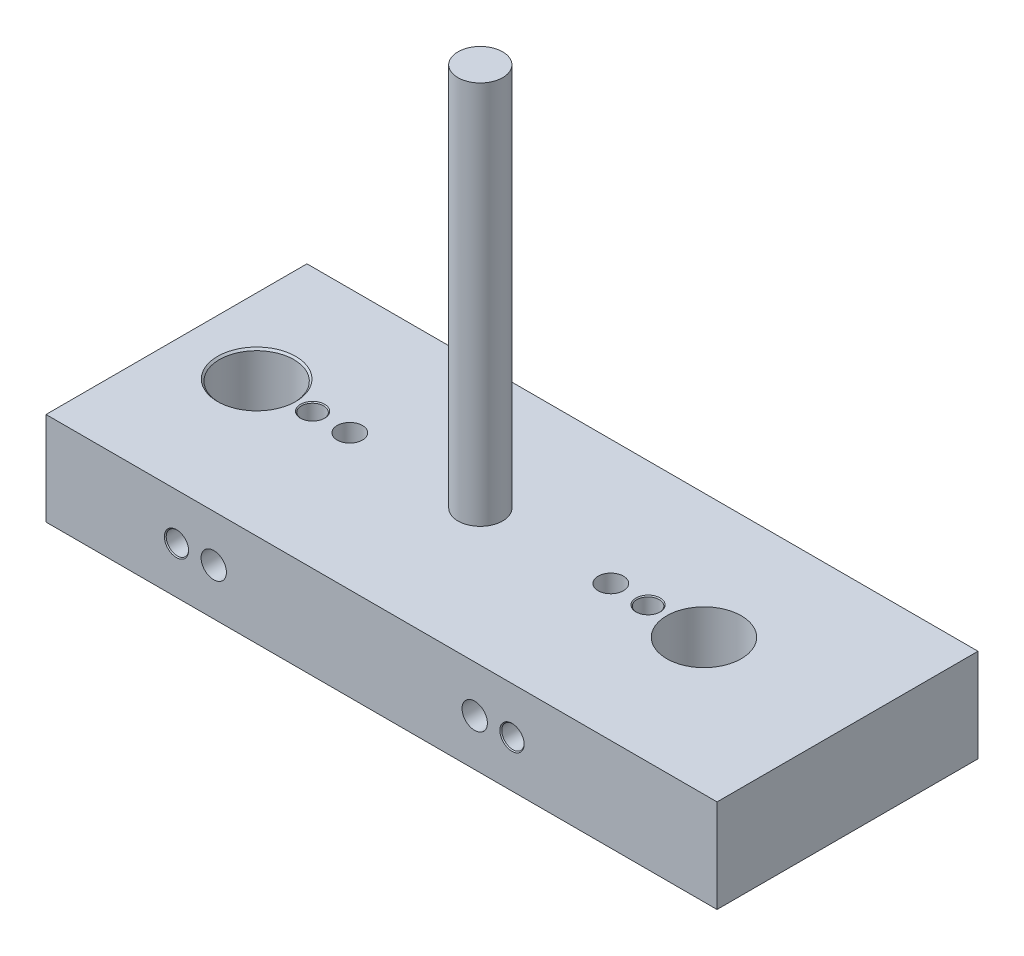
ISO-10303-21;
HEADER;
FILE_DESCRIPTION(('STEP AP214'),'2;1');
FILE_NAME('part.step','',(''),(''),'','','');
FILE_SCHEMA(('AUTOMOTIVE_DESIGN { 1 0 10303 214 1 1 1 1 }'));
ENDSEC;
DATA;
#1=APPLICATION_CONTEXT('core data for automotive mechanical design processes');
#2=APPLICATION_PROTOCOL_DEFINITION('international standard','automotive_design',2000,#1);
#3=PRODUCT_CONTEXT('',#1,'mechanical');
#4=PRODUCT('Part','Part','',(#3));
#5=PRODUCT_RELATED_PRODUCT_CATEGORY('part','',(#4));
#6=PRODUCT_DEFINITION_FORMATION('','',#4);
#7=PRODUCT_DEFINITION_CONTEXT('part definition',#1,'design');
#8=PRODUCT_DEFINITION('design','',#6,#7);
#9=PRODUCT_DEFINITION_SHAPE('','',#8);
#10=(LENGTH_UNIT() NAMED_UNIT(*) SI_UNIT(.MILLI.,.METRE.));
#11=(NAMED_UNIT(*) PLANE_ANGLE_UNIT() SI_UNIT($,.RADIAN.));
#12=(NAMED_UNIT(*) SI_UNIT($,.STERADIAN.) SOLID_ANGLE_UNIT());
#13=UNCERTAINTY_MEASURE_WITH_UNIT(LENGTH_MEASURE(1.E-05),#10,'distance_accuracy_value','');
#14=(GEOMETRIC_REPRESENTATION_CONTEXT(3) GLOBAL_UNCERTAINTY_ASSIGNED_CONTEXT((#13)) GLOBAL_UNIT_ASSIGNED_CONTEXT((#10,
#11,#12)) REPRESENTATION_CONTEXT('',''));
#15=CARTESIAN_POINT('',(0.,0.,0.));
#16=DIRECTION('',(0.,0.,1.));
#17=DIRECTION('',(1.,0.,0.));
#18=AXIS2_PLACEMENT_3D('',#15,#16,#17);
#19=CARTESIAN_POINT('',(0.,25.,-70.));
#20=DIRECTION('',(0.,-1.,0.));
#21=DIRECTION('',(0.,0.,-1.));
#22=AXIS2_PLACEMENT_3D('',#19,#20,#21);
#23=PLANE('',#22);
#24=CARTESIAN_POINT('',(140.,25.,-36.5));
#25=DIRECTION('',(0.,-1.,0.));
#26=DIRECTION('',(0.,0.,-1.));
#27=AXIS2_PLACEMENT_3D('',#24,#25,#26);
#28=CIRCLE('',#27,9.99999999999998);
#29=CARTESIAN_POINT('',(140.,25.,-46.5));
#30=VERTEX_POINT('',#29);
#31=EDGE_CURVE('E9178',#30,#30,#28,.T.);
#32=ORIENTED_EDGE('',*,*,#31,.T.);
#33=EDGE_LOOP('',(#32));
#34=FACE_BOUND('',#33,.T.);
#35=DIRECTION('',(0.,0.,1.));
#36=VECTOR('',#35,1.);
#37=CARTESIAN_POINT('',(0.,25.,0.));
#38=LINE('',#37,#36);
#39=CARTESIAN_POINT('',(0.,25.,-70.));
#40=VERTEX_POINT('',#39);
#41=CARTESIAN_POINT('',(0.,25.,0.));
#42=VERTEX_POINT('',#41);
#43=EDGE_CURVE('E9306',#40,#42,#38,.T.);
#44=ORIENTED_EDGE('',*,*,#43,.T.);
#45=DIRECTION('',(1.,0.,0.));
#46=VECTOR('',#45,1.);
#47=CARTESIAN_POINT('',(0.,25.,0.));
#48=LINE('',#47,#46);
#49=CARTESIAN_POINT('',(180.,25.,0.));
#50=VERTEX_POINT('',#49);
#51=EDGE_CURVE('E9304',#42,#50,#48,.T.);
#52=ORIENTED_EDGE('',*,*,#51,.T.);
#53=DIRECTION('',(0.,0.,-1.));
#54=VECTOR('',#53,1.);
#55=CARTESIAN_POINT('',(180.,25.,0.));
#56=LINE('',#55,#54);
#57=CARTESIAN_POINT('',(180.,25.,-70.));
#58=VERTEX_POINT('',#57);
#59=EDGE_CURVE('E9302',#50,#58,#56,.T.);
#60=ORIENTED_EDGE('',*,*,#59,.T.);
#61=DIRECTION('',(-1.,0.,0.));
#62=VECTOR('',#61,1.);
#63=CARTESIAN_POINT('',(0.,25.,-70.));
#64=LINE('',#63,#62);
#65=EDGE_CURVE('E9300',#58,#40,#64,.T.);
#66=ORIENTED_EDGE('',*,*,#65,.T.);
#67=EDGE_LOOP('',(#44,#52,#60,#66));
#68=FACE_BOUND('',#67,.T.);
#69=CARTESIAN_POINT('',(20.,25.,-36.5));
#70=DIRECTION('',(0.,-1.,0.));
#71=DIRECTION('',(0.,0.,-1.));
#72=AXIS2_PLACEMENT_3D('',#69,#70,#71);
#73=CIRCLE('',#72,10.5);
#74=CARTESIAN_POINT('',(20.,25.,-47.));
#75=VERTEX_POINT('',#74);
#76=EDGE_CURVE('E9327',#75,#75,#73,.T.);
#77=ORIENTED_EDGE('',*,*,#76,.T.);
#78=EDGE_LOOP('',(#77));
#79=FACE_BOUND('',#78,.T.);
#80=CARTESIAN_POINT('',(45.,25.,-36.5));
#81=DIRECTION('',(0.,-1.,0.));
#82=DIRECTION('',(0.,0.,-1.));
#83=AXIS2_PLACEMENT_3D('',#80,#81,#82);
#84=CIRCLE('',#83,3.39999999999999);
#85=CARTESIAN_POINT('',(45.,25.,-39.9));
#86=VERTEX_POINT('',#85);
#87=EDGE_CURVE('E9333',#86,#86,#84,.T.);
#88=ORIENTED_EDGE('',*,*,#87,.T.);
#89=EDGE_LOOP('',(#88));
#90=FACE_BOUND('',#89,.T.);
#91=CARTESIAN_POINT('',(115.,25.,-36.5));
#92=DIRECTION('',(0.,-1.,0.));
#93=DIRECTION('',(0.,0.,-1.));
#94=AXIS2_PLACEMENT_3D('',#91,#92,#93);
#95=CIRCLE('',#94,3.4);
#96=CARTESIAN_POINT('',(115.,25.,-39.9));
#97=VERTEX_POINT('',#96);
#98=EDGE_CURVE('E9339',#97,#97,#95,.T.);
#99=ORIENTED_EDGE('',*,*,#98,.T.);
#100=EDGE_LOOP('',(#99));
#101=FACE_BOUND('',#100,.T.);
#102=CARTESIAN_POINT('',(35.,25.,-36.5));
#103=DIRECTION('',(0.,-1.,0.));
#104=DIRECTION('',(0.,0.,-1.));
#105=AXIS2_PLACEMENT_3D('',#102,#103,#104);
#106=CIRCLE('',#105,3.25);
#107=CARTESIAN_POINT('',(35.,25.,-39.75));
#108=VERTEX_POINT('',#107);
#109=EDGE_CURVE('E9351',#108,#108,#106,.T.);
#110=ORIENTED_EDGE('',*,*,#109,.T.);
#111=EDGE_LOOP('',(#110));
#112=FACE_BOUND('',#111,.T.);
#113=CARTESIAN_POINT('',(125.,25.,-36.5));
#114=DIRECTION('',(0.,-1.,0.));
#115=DIRECTION('',(0.,0.,-1.));
#116=AXIS2_PLACEMENT_3D('',#113,#114,#115);
#117=CIRCLE('',#116,3.25);
#118=CARTESIAN_POINT('',(125.,25.,-39.75));
#119=VERTEX_POINT('',#118);
#120=EDGE_CURVE('E9363',#119,#119,#117,.T.);
#121=ORIENTED_EDGE('',*,*,#120,.T.);
#122=EDGE_LOOP('',(#121));
#123=FACE_BOUND('',#122,.T.);
#124=CARTESIAN_POINT('',(80.,25.,-36.5));
#125=DIRECTION('',(0.,-1.,0.));
#126=DIRECTION('',(0.,0.,-1.));
#127=AXIS2_PLACEMENT_3D('',#124,#125,#126);
#128=CIRCLE('',#127,6.);
#129=CARTESIAN_POINT('',(80.,25.,-42.5));
#130=VERTEX_POINT('',#129);
#131=EDGE_CURVE('E11',#130,#130,#128,.F.);
#132=ORIENTED_EDGE('',*,*,#131,.F.);
#133=EDGE_LOOP('',(#132));
#134=FACE_BOUND('',#133,.T.);
#135=ADVANCED_FACE('F9174',(#34,#68,#79,#90,#101,#112,#123,#134),#23,.F.);
#136=CARTESIAN_POINT('',(115.,0.,-36.5));
#137=DIRECTION('',(0.,-1.,0.));
#138=DIRECTION('',(0.,0.,-1.));
#139=AXIS2_PLACEMENT_3D('',#136,#137,#138);
#140=CYLINDRICAL_SURFACE('',#139,3.4);
#141=CARTESIAN_POINT('',(115.,0.,-36.5));
#142=DIRECTION('',(0.,-1.,0.));
#143=DIRECTION('',(0.,0.,-1.));
#144=AXIS2_PLACEMENT_3D('',#141,#142,#143);
#145=CIRCLE('',#144,3.4);
#146=CARTESIAN_POINT('',(115.,0.,-39.9));
#147=VERTEX_POINT('',#146);
#148=EDGE_CURVE('E9336',#147,#147,#145,.T.);
#149=ORIENTED_EDGE('',*,*,#148,.T.);
#150=EDGE_LOOP('',(#149));
#151=FACE_BOUND('',#150,.T.);
#152=CARTESIAN_POINT('',(115.,12.5,-36.5));
#153=DIRECTION('',(0.,-0.707106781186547,-0.707106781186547));
#154=DIRECTION('',(0.,-0.707106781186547,0.707106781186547));
#155=AXIS2_PLACEMENT_3D('',#152,#153,#154);
#156=ELLIPSE('',#155,4.80832611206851,3.39999999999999);
#157=CARTESIAN_POINT('',(111.6,12.5,-36.5));
#158=VERTEX_POINT('',#157);
#159=CARTESIAN_POINT('',(118.4,12.5,-36.5));
#160=VERTEX_POINT('',#159);
#161=EDGE_CURVE('E9189',#158,#160,#156,.F.);
#162=ORIENTED_EDGE('',*,*,#161,.T.);
#163=CARTESIAN_POINT('',(115.,12.5,-36.5));
#164=DIRECTION('',(0.,-0.707106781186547,0.707106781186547));
#165=DIRECTION('',(0.,-0.707106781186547,-0.707106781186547));
#166=AXIS2_PLACEMENT_3D('',#163,#164,#165);
#167=ELLIPSE('',#166,4.80832611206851,3.39999999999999);
#168=EDGE_CURVE('E9183',#160,#158,#167,.F.);
#169=ORIENTED_EDGE('',*,*,#168,.T.);
#170=EDGE_LOOP('',(#162,#169));
#171=FACE_BOUND('',#170,.T.);
#172=ADVANCED_FACE('F9252',(#151,#171),#140,.F.);
#173=CARTESIAN_POINT('',(45.,0.,-36.5));
#174=DIRECTION('',(0.,-1.,0.));
#175=DIRECTION('',(0.,0.,-1.));
#176=AXIS2_PLACEMENT_3D('',#173,#174,#175);
#177=CYLINDRICAL_SURFACE('',#176,3.4);
#178=CARTESIAN_POINT('',(45.,0.,-36.5));
#179=DIRECTION('',(0.,-1.,0.));
#180=DIRECTION('',(0.,0.,-1.));
#181=AXIS2_PLACEMENT_3D('',#178,#179,#180);
#182=CIRCLE('',#181,3.4);
#183=CARTESIAN_POINT('',(45.,0.,-39.9));
#184=VERTEX_POINT('',#183);
#185=EDGE_CURVE('E9330',#184,#184,#182,.T.);
#186=ORIENTED_EDGE('',*,*,#185,.T.);
#187=EDGE_LOOP('',(#186));
#188=FACE_BOUND('',#187,.T.);
#189=CARTESIAN_POINT('',(45.,12.5,-36.5));
#190=DIRECTION('',(0.,-0.707106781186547,-0.707106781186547));
#191=DIRECTION('',(0.,-0.707106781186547,0.707106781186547));
#192=AXIS2_PLACEMENT_3D('',#189,#190,#191);
#193=ELLIPSE('',#192,4.80832611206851,3.39999999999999);
#194=CARTESIAN_POINT('',(41.6,12.5,-36.5));
#195=VERTEX_POINT('',#194);
#196=CARTESIAN_POINT('',(48.4,12.5,-36.5));
#197=VERTEX_POINT('',#196);
#198=EDGE_CURVE('E9196',#195,#197,#193,.F.);
#199=ORIENTED_EDGE('',*,*,#198,.T.);
#200=CARTESIAN_POINT('',(45.,12.5,-36.5));
#201=DIRECTION('',(0.,-0.707106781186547,0.707106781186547));
#202=DIRECTION('',(0.,-0.707106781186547,-0.707106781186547));
#203=AXIS2_PLACEMENT_3D('',#200,#201,#202);
#204=ELLIPSE('',#203,4.80832611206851,3.39999999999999);
#205=EDGE_CURVE('E9250',#197,#195,#204,.F.);
#206=ORIENTED_EDGE('',*,*,#205,.T.);
#207=EDGE_LOOP('',(#199,#206));
#208=FACE_BOUND('',#207,.T.);
#209=ADVANCED_FACE('F9549',(#188,#208),#177,.F.);
#210=CARTESIAN_POINT('',(125.,0.,-36.5));
#211=DIRECTION('',(0.,-1.,0.));
#212=DIRECTION('',(0.,0.,-1.));
#213=AXIS2_PLACEMENT_3D('',#210,#211,#212);
#214=CYLINDRICAL_SURFACE('',#213,3.);
#215=CARTESIAN_POINT('',(125.,0.250000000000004,-36.5));
#216=DIRECTION('',(0.,-1.,0.));
#217=DIRECTION('',(0.,0.,-1.));
#218=AXIS2_PLACEMENT_3D('',#215,#216,#217);
#219=CIRCLE('',#218,3.);
#220=CARTESIAN_POINT('',(125.,0.250000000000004,-39.5));
#221=VERTEX_POINT('',#220);
#222=EDGE_CURVE('E9357',#221,#221,#219,.T.);
#223=ORIENTED_EDGE('',*,*,#222,.T.);
#224=EDGE_LOOP('',(#223));
#225=FACE_BOUND('',#224,.T.);
#226=CARTESIAN_POINT('',(125.,12.5,-36.5));
#227=DIRECTION('',(0.,-0.707106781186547,-0.707106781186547));
#228=DIRECTION('',(0.,-0.707106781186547,0.707106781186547));
#229=AXIS2_PLACEMENT_3D('',#226,#227,#228);
#230=ELLIPSE('',#229,4.24264068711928,3.);
#231=CARTESIAN_POINT('',(122.,12.5,-36.5));
#232=VERTEX_POINT('',#231);
#233=CARTESIAN_POINT('',(128.,12.5,-36.5));
#234=VERTEX_POINT('',#233);
#235=EDGE_CURVE('E9275',#232,#234,#230,.F.);
#236=ORIENTED_EDGE('',*,*,#235,.T.);
#237=CARTESIAN_POINT('',(125.,12.5,-36.5));
#238=DIRECTION('',(0.,-0.707106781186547,0.707106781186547));
#239=DIRECTION('',(0.,-0.707106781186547,-0.707106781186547));
#240=AXIS2_PLACEMENT_3D('',#237,#238,#239);
#241=ELLIPSE('',#240,4.24264068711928,3.);
#242=EDGE_CURVE('E9266',#234,#232,#241,.F.);
#243=ORIENTED_EDGE('',*,*,#242,.T.);
#244=EDGE_LOOP('',(#236,#243));
#245=FACE_BOUND('',#244,.T.);
#246=ADVANCED_FACE('F9525',(#225,#245),#214,.F.);
#247=CARTESIAN_POINT('',(35.,0.,-36.5));
#248=DIRECTION('',(0.,-1.,0.));
#249=DIRECTION('',(0.,0.,-1.));
#250=AXIS2_PLACEMENT_3D('',#247,#248,#249);
#251=CYLINDRICAL_SURFACE('',#250,3.);
#252=CARTESIAN_POINT('',(35.,0.250000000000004,-36.5));
#253=DIRECTION('',(0.,-1.,0.));
#254=DIRECTION('',(0.,0.,-1.));
#255=AXIS2_PLACEMENT_3D('',#252,#253,#254);
#256=CIRCLE('',#255,3.);
#257=CARTESIAN_POINT('',(35.,0.250000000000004,-39.5));
#258=VERTEX_POINT('',#257);
#259=EDGE_CURVE('E9345',#258,#258,#256,.T.);
#260=ORIENTED_EDGE('',*,*,#259,.T.);
#261=EDGE_LOOP('',(#260));
#262=FACE_BOUND('',#261,.T.);
#263=CARTESIAN_POINT('',(35.,12.5,-36.5));
#264=DIRECTION('',(0.,-0.707106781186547,-0.707106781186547));
#265=DIRECTION('',(0.,-0.707106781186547,0.707106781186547));
#266=AXIS2_PLACEMENT_3D('',#263,#264,#265);
#267=ELLIPSE('',#266,4.24264068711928,2.99999999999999);
#268=CARTESIAN_POINT('',(32.,12.5,-36.5));
#269=VERTEX_POINT('',#268);
#270=CARTESIAN_POINT('',(38.,12.5,-36.5));
#271=VERTEX_POINT('',#270);
#272=EDGE_CURVE('E9286',#269,#271,#267,.F.);
#273=ORIENTED_EDGE('',*,*,#272,.T.);
#274=CARTESIAN_POINT('',(35.,12.5,-36.5));
#275=DIRECTION('',(0.,-0.707106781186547,0.707106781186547));
#276=DIRECTION('',(0.,-0.707106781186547,-0.707106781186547));
#277=AXIS2_PLACEMENT_3D('',#274,#275,#276);
#278=ELLIPSE('',#277,4.24264068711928,2.99999999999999);
#279=EDGE_CURVE('E9277',#271,#269,#278,.F.);
#280=ORIENTED_EDGE('',*,*,#279,.T.);
#281=EDGE_LOOP('',(#273,#280));
#282=FACE_BOUND('',#281,.T.);
#283=ADVANCED_FACE('F9538',(#262,#282),#251,.F.);
#284=CARTESIAN_POINT('',(0.,25.,0.));
#285=DIRECTION('',(1.,0.,0.));
#286=DIRECTION('',(0.,0.,-1.));
#287=AXIS2_PLACEMENT_3D('',#284,#285,#286);
#288=PLANE('',#287);
#289=DIRECTION('',(0.,0.,1.));
#290=VECTOR('',#289,1.);
#291=CARTESIAN_POINT('',(0.,0.,0.));
#292=LINE('',#291,#290);
#293=CARTESIAN_POINT('',(0.,0.,-70.));
#294=VERTEX_POINT('',#293);
#295=CARTESIAN_POINT('',(0.,0.,0.));
#296=VERTEX_POINT('',#295);
#297=EDGE_CURVE('E9315',#294,#296,#292,.T.);
#298=ORIENTED_EDGE('',*,*,#297,.T.);
#299=DIRECTION('',(0.,-1.,0.));
#300=VECTOR('',#299,1.);
#301=CARTESIAN_POINT('',(0.,25.,0.));
#302=LINE('',#301,#300);
#303=EDGE_CURVE('E9288',#42,#296,#302,.T.);
#304=ORIENTED_EDGE('',*,*,#303,.F.);
#305=ORIENTED_EDGE('',*,*,#43,.F.);
#306=DIRECTION('',(0.,-1.,0.));
#307=VECTOR('',#306,1.);
#308=CARTESIAN_POINT('',(0.,25.,-70.));
#309=LINE('',#308,#307);
#310=EDGE_CURVE('E9297',#40,#294,#309,.T.);
#311=ORIENTED_EDGE('',*,*,#310,.T.);
#312=EDGE_LOOP('',(#298,#304,#305,#311));
#313=FACE_BOUND('',#312,.T.);
#314=ADVANCED_FACE('F9176',(#313),#288,.F.);
#315=CARTESIAN_POINT('',(0.,25.,0.));
#316=DIRECTION('',(0.,0.,-1.));
#317=DIRECTION('',(-1.,0.,0.));
#318=AXIS2_PLACEMENT_3D('',#315,#316,#317);
#319=PLANE('',#318);
#320=CARTESIAN_POINT('',(115.,12.5,0.));
#321=DIRECTION('',(0.,0.,1.));
#322=DIRECTION('',(1.,0.,0.));
#323=AXIS2_PLACEMENT_3D('',#320,#321,#322);
#324=CIRCLE('',#323,3.39999999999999);
#325=CARTESIAN_POINT('',(118.4,12.5,0.));
#326=VERTEX_POINT('',#325);
#327=EDGE_CURVE('E9396',#326,#326,#324,.T.);
#328=ORIENTED_EDGE('',*,*,#327,.F.);
#329=EDGE_LOOP('',(#328));
#330=FACE_BOUND('',#329,.T.);
#331=CARTESIAN_POINT('',(45.,12.5,0.));
#332=DIRECTION('',(0.,0.,1.));
#333=DIRECTION('',(1.,0.,0.));
#334=AXIS2_PLACEMENT_3D('',#331,#332,#333);
#335=CIRCLE('',#334,3.39999999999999);
#336=CARTESIAN_POINT('',(48.4,12.5,0.));
#337=VERTEX_POINT('',#336);
#338=EDGE_CURVE('E9390',#337,#337,#335,.T.);
#339=ORIENTED_EDGE('',*,*,#338,.F.);
#340=EDGE_LOOP('',(#339));
#341=FACE_BOUND('',#340,.T.);
#342=CARTESIAN_POINT('',(125.,12.5,0.));
#343=DIRECTION('',(0.,0.,1.));
#344=DIRECTION('',(1.,0.,0.));
#345=AXIS2_PLACEMENT_3D('',#342,#343,#344);
#346=CIRCLE('',#345,3.25);
#347=CARTESIAN_POINT('',(128.25,12.5,0.));
#348=VERTEX_POINT('',#347);
#349=EDGE_CURVE('E9378',#348,#348,#346,.T.);
#350=ORIENTED_EDGE('',*,*,#349,.F.);
#351=EDGE_LOOP('',(#350));
#352=FACE_BOUND('',#351,.T.);
#353=CARTESIAN_POINT('',(35.,12.5,0.));
#354=DIRECTION('',(0.,0.,1.));
#355=DIRECTION('',(1.,0.,0.));
#356=AXIS2_PLACEMENT_3D('',#353,#354,#355);
#357=CIRCLE('',#356,3.25);
#358=CARTESIAN_POINT('',(38.25,12.5,0.));
#359=VERTEX_POINT('',#358);
#360=EDGE_CURVE('E9366',#359,#359,#357,.T.);
#361=ORIENTED_EDGE('',*,*,#360,.F.);
#362=EDGE_LOOP('',(#361));
#363=FACE_BOUND('',#362,.T.);
#364=DIRECTION('',(1.,0.,0.));
#365=VECTOR('',#364,1.);
#366=CARTESIAN_POINT('',(0.,0.,0.));
#367=LINE('',#366,#365);
#368=CARTESIAN_POINT('',(180.,0.,0.));
#369=VERTEX_POINT('',#368);
#370=EDGE_CURVE('E9313',#296,#369,#367,.T.);
#371=ORIENTED_EDGE('',*,*,#370,.T.);
#372=DIRECTION('',(0.,-1.,0.));
#373=VECTOR('',#372,1.);
#374=CARTESIAN_POINT('',(180.,25.,0.));
#375=LINE('',#374,#373);
#376=EDGE_CURVE('E9291',#50,#369,#375,.T.);
#377=ORIENTED_EDGE('',*,*,#376,.F.);
#378=ORIENTED_EDGE('',*,*,#51,.F.);
#379=ORIENTED_EDGE('',*,*,#303,.T.);
#380=EDGE_LOOP('',(#371,#377,#378,#379));
#381=FACE_BOUND('',#380,.T.);
#382=ADVANCED_FACE('F9452',(#330,#341,#352,#363,#381),#319,.F.);
#383=CARTESIAN_POINT('',(180.,25.,0.));
#384=DIRECTION('',(-1.,0.,0.));
#385=DIRECTION('',(0.,0.,1.));
#386=AXIS2_PLACEMENT_3D('',#383,#384,#385);
#387=PLANE('',#386);
#388=DIRECTION('',(0.,0.,-1.));
#389=VECTOR('',#388,1.);
#390=CARTESIAN_POINT('',(180.,0.,0.));
#391=LINE('',#390,#389);
#392=CARTESIAN_POINT('',(180.,0.,-70.));
#393=VERTEX_POINT('',#392);
#394=EDGE_CURVE('E9311',#369,#393,#391,.T.);
#395=ORIENTED_EDGE('',*,*,#394,.T.);
#396=DIRECTION('',(0.,-1.,0.));
#397=VECTOR('',#396,1.);
#398=CARTESIAN_POINT('',(180.,25.,-70.));
#399=LINE('',#398,#397);
#400=EDGE_CURVE('E9294',#58,#393,#399,.T.);
#401=ORIENTED_EDGE('',*,*,#400,.F.);
#402=ORIENTED_EDGE('',*,*,#59,.F.);
#403=ORIENTED_EDGE('',*,*,#376,.T.);
#404=EDGE_LOOP('',(#395,#401,#402,#403));
#405=FACE_BOUND('',#404,.T.);
#406=ADVANCED_FACE('F9449',(#405),#387,.F.);
#407=CARTESIAN_POINT('',(0.,25.,-70.));
#408=DIRECTION('',(0.,0.,1.));
#409=DIRECTION('',(1.,0.,0.));
#410=AXIS2_PLACEMENT_3D('',#407,#408,#409);
#411=PLANE('',#410);
#412=CARTESIAN_POINT('',(115.,12.5,-70.));
#413=DIRECTION('',(0.,0.,1.));
#414=DIRECTION('',(1.,0.,0.));
#415=AXIS2_PLACEMENT_3D('',#412,#413,#414);
#416=CIRCLE('',#415,3.39999999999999);
#417=CARTESIAN_POINT('',(118.4,12.5,-70.));
#418=VERTEX_POINT('',#417);
#419=EDGE_CURVE('E9399',#418,#418,#416,.T.);
#420=ORIENTED_EDGE('',*,*,#419,.T.);
#421=EDGE_LOOP('',(#420));
#422=FACE_BOUND('',#421,.T.);
#423=CARTESIAN_POINT('',(45.,12.5,-70.));
#424=DIRECTION('',(0.,0.,1.));
#425=DIRECTION('',(1.,0.,0.));
#426=AXIS2_PLACEMENT_3D('',#423,#424,#425);
#427=CIRCLE('',#426,3.39999999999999);
#428=CARTESIAN_POINT('',(48.4,12.5,-70.));
#429=VERTEX_POINT('',#428);
#430=EDGE_CURVE('E9393',#429,#429,#427,.T.);
#431=ORIENTED_EDGE('',*,*,#430,.T.);
#432=EDGE_LOOP('',(#431));
#433=FACE_BOUND('',#432,.T.);
#434=CARTESIAN_POINT('',(125.,12.5,-70.));
#435=DIRECTION('',(0.,0.,1.));
#436=DIRECTION('',(1.,0.,0.));
#437=AXIS2_PLACEMENT_3D('',#434,#435,#436);
#438=CIRCLE('',#437,3.24999999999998);
#439=CARTESIAN_POINT('',(128.25,12.5,-70.));
#440=VERTEX_POINT('',#439);
#441=EDGE_CURVE('E9387',#440,#440,#438,.T.);
#442=ORIENTED_EDGE('',*,*,#441,.T.);
#443=EDGE_LOOP('',(#442));
#444=FACE_BOUND('',#443,.T.);
#445=CARTESIAN_POINT('',(35.,12.5,-70.));
#446=DIRECTION('',(0.,0.,1.));
#447=DIRECTION('',(1.,0.,0.));
#448=AXIS2_PLACEMENT_3D('',#445,#446,#447);
#449=CIRCLE('',#448,3.24999999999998);
#450=CARTESIAN_POINT('',(38.25,12.5,-70.));
#451=VERTEX_POINT('',#450);
#452=EDGE_CURVE('E9375',#451,#451,#449,.T.);
#453=ORIENTED_EDGE('',*,*,#452,.T.);
#454=EDGE_LOOP('',(#453));
#455=FACE_BOUND('',#454,.T.);
#456=DIRECTION('',(-1.,0.,0.));
#457=VECTOR('',#456,1.);
#458=CARTESIAN_POINT('',(0.,0.,-70.));
#459=LINE('',#458,#457);
#460=EDGE_CURVE('E9309',#393,#294,#459,.T.);
#461=ORIENTED_EDGE('',*,*,#460,.T.);
#462=ORIENTED_EDGE('',*,*,#310,.F.);
#463=ORIENTED_EDGE('',*,*,#65,.F.);
#464=ORIENTED_EDGE('',*,*,#400,.T.);
#465=EDGE_LOOP('',(#461,#462,#463,#464));
#466=FACE_BOUND('',#465,.T.);
#467=ADVANCED_FACE('F9425',(#422,#433,#444,#455,#466),#411,.F.);
#468=CARTESIAN_POINT('',(0.,0.,-70.));
#469=DIRECTION('',(0.,-1.,0.));
#470=DIRECTION('',(0.,0.,-1.));
#471=AXIS2_PLACEMENT_3D('',#468,#469,#470);
#472=PLANE('',#471);
#473=CARTESIAN_POINT('',(140.,0.,-36.5));
#474=DIRECTION('',(0.,-1.,0.));
#475=DIRECTION('',(0.,0.,-1.));
#476=AXIS2_PLACEMENT_3D('',#473,#474,#475);
#477=CIRCLE('',#476,10.5);
#478=CARTESIAN_POINT('',(140.,0.,-47.));
#479=VERTEX_POINT('',#478);
#480=EDGE_CURVE('E9405',#479,#479,#477,.T.);
#481=ORIENTED_EDGE('',*,*,#480,.F.);
#482=EDGE_LOOP('',(#481));
#483=FACE_BOUND('',#482,.T.);
#484=CARTESIAN_POINT('',(125.,0.,-36.5));
#485=DIRECTION('',(0.,-1.,0.));
#486=DIRECTION('',(0.,0.,-1.));
#487=AXIS2_PLACEMENT_3D('',#484,#485,#486);
#488=CIRCLE('',#487,3.25);
#489=CARTESIAN_POINT('',(125.,0.,-39.75));
#490=VERTEX_POINT('',#489);
#491=EDGE_CURVE('E9354',#490,#490,#488,.T.);
#492=ORIENTED_EDGE('',*,*,#491,.F.);
#493=EDGE_LOOP('',(#492));
#494=FACE_BOUND('',#493,.T.);
#495=CARTESIAN_POINT('',(35.,0.,-36.5));
#496=DIRECTION('',(0.,-1.,0.));
#497=DIRECTION('',(0.,0.,-1.));
#498=AXIS2_PLACEMENT_3D('',#495,#496,#497);
#499=CIRCLE('',#498,3.25);
#500=CARTESIAN_POINT('',(35.,0.,-39.75));
#501=VERTEX_POINT('',#500);
#502=EDGE_CURVE('E9342',#501,#501,#499,.T.);
#503=ORIENTED_EDGE('',*,*,#502,.F.);
#504=EDGE_LOOP('',(#503));
#505=FACE_BOUND('',#504,.T.);
#506=ORIENTED_EDGE('',*,*,#148,.F.);
#507=EDGE_LOOP('',(#506));
#508=FACE_BOUND('',#507,.T.);
#509=ORIENTED_EDGE('',*,*,#185,.F.);
#510=EDGE_LOOP('',(#509));
#511=FACE_BOUND('',#510,.T.);
#512=CARTESIAN_POINT('',(20.,0.,-36.5));
#513=DIRECTION('',(0.,-1.,0.));
#514=DIRECTION('',(0.,0.,-1.));
#515=AXIS2_PLACEMENT_3D('',#512,#513,#514);
#516=CIRCLE('',#515,10.5);
#517=CARTESIAN_POINT('',(20.,0.,-47.));
#518=VERTEX_POINT('',#517);
#519=EDGE_CURVE('E9318',#518,#518,#516,.T.);
#520=ORIENTED_EDGE('',*,*,#519,.F.);
#521=EDGE_LOOP('',(#520));
#522=FACE_BOUND('',#521,.T.);
#523=ORIENTED_EDGE('',*,*,#297,.F.);
#524=ORIENTED_EDGE('',*,*,#460,.F.);
#525=ORIENTED_EDGE('',*,*,#394,.F.);
#526=ORIENTED_EDGE('',*,*,#370,.F.);
#527=EDGE_LOOP('',(#523,#524,#525,#526));
#528=FACE_BOUND('',#527,.T.);
#529=ADVANCED_FACE('F9421',(#483,#494,#505,#508,#511,#522,#528),#472,.T.);
#530=CARTESIAN_POINT('',(20.,0.,-36.5));
#531=DIRECTION('',(0.,-1.,0.));
#532=DIRECTION('',(0.,0.,-1.));
#533=AXIS2_PLACEMENT_3D('',#530,#531,#532);
#534=CONICAL_SURFACE('',#533,10.5,0.785398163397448);
#535=CARTESIAN_POINT('',(20.,0.500000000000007,-36.5));
#536=DIRECTION('',(0.,-1.,0.));
#537=DIRECTION('',(0.,0.,-1.));
#538=AXIS2_PLACEMENT_3D('',#535,#536,#537);
#539=CIRCLE('',#538,9.99999999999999);
#540=CARTESIAN_POINT('',(20.,0.500000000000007,-46.5));
#541=VERTEX_POINT('',#540);
#542=EDGE_CURVE('E9321',#541,#541,#539,.T.);
#543=ORIENTED_EDGE('',*,*,#542,.F.);
#544=EDGE_LOOP('',(#543));
#545=FACE_BOUND('',#544,.T.);
#546=ORIENTED_EDGE('',*,*,#519,.T.);
#547=EDGE_LOOP('',(#546));
#548=FACE_BOUND('',#547,.T.);
#549=ADVANCED_FACE('F9424',(#545,#548),#534,.F.);
#550=CARTESIAN_POINT('',(20.,0.,-36.5));
#551=DIRECTION('',(0.,-1.,0.));
#552=DIRECTION('',(0.,0.,-1.));
#553=AXIS2_PLACEMENT_3D('',#550,#551,#552);
#554=CYLINDRICAL_SURFACE('',#553,9.99999999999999);
#555=CARTESIAN_POINT('',(20.,24.5,-36.5));
#556=DIRECTION('',(0.,-1.,0.));
#557=DIRECTION('',(0.,0.,-1.));
#558=AXIS2_PLACEMENT_3D('',#555,#556,#557);
#559=CIRCLE('',#558,9.99999999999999);
#560=CARTESIAN_POINT('',(20.,24.5,-46.5));
#561=VERTEX_POINT('',#560);
#562=EDGE_CURVE('E9324',#561,#561,#559,.T.);
#563=ORIENTED_EDGE('',*,*,#562,.F.);
#564=EDGE_LOOP('',(#563));
#565=FACE_BOUND('',#564,.T.);
#566=ORIENTED_EDGE('',*,*,#542,.T.);
#567=EDGE_LOOP('',(#566));
#568=FACE_BOUND('',#567,.T.);
#569=ADVANCED_FACE('F9552',(#565,#568),#554,.F.);
#570=CARTESIAN_POINT('',(20.,24.5,-36.5));
#571=DIRECTION('',(0.,1.,0.));
#572=DIRECTION('',(0.,0.,1.));
#573=AXIS2_PLACEMENT_3D('',#570,#571,#572);
#574=CONICAL_SURFACE('',#573,9.99999999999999,0.785398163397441);
#575=ORIENTED_EDGE('',*,*,#76,.F.);
#576=EDGE_LOOP('',(#575));
#577=FACE_BOUND('',#576,.T.);
#578=ORIENTED_EDGE('',*,*,#562,.T.);
#579=EDGE_LOOP('',(#578));
#580=FACE_BOUND('',#579,.T.);
#581=ADVANCED_FACE('F9547',(#577,#580),#574,.F.);
#582=CARTESIAN_POINT('',(45.,12.5,-36.5));
#583=DIRECTION('',(0.,-0.707106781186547,-0.707106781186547));
#584=DIRECTION('',(0.,-0.707106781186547,0.707106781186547));
#585=AXIS2_PLACEMENT_3D('',#582,#583,#584);
#586=ELLIPSE('',#585,4.80832611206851,3.39999999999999);
#587=EDGE_CURVE('E9262',#195,#197,#586,.T.);
#588=ORIENTED_EDGE('',*,*,#587,.T.);
#589=CARTESIAN_POINT('',(45.,12.5,-36.5));
#590=DIRECTION('',(0.,-0.707106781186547,0.707106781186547));
#591=DIRECTION('',(0.,-0.707106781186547,-0.707106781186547));
#592=AXIS2_PLACEMENT_3D('',#589,#590,#591);
#593=ELLIPSE('',#592,4.80832611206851,3.39999999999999);
#594=EDGE_CURVE('E9259',#197,#195,#593,.T.);
#595=ORIENTED_EDGE('',*,*,#594,.T.);
#596=EDGE_LOOP('',(#588,#595));
#597=FACE_BOUND('',#596,.T.);
#598=ORIENTED_EDGE('',*,*,#87,.F.);
#599=EDGE_LOOP('',(#598));
#600=FACE_BOUND('',#599,.T.);
#601=ADVANCED_FACE('F9544',(#597,#600),#177,.F.);
#602=CARTESIAN_POINT('',(115.,12.5,-36.5));
#603=DIRECTION('',(0.,-0.707106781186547,-0.707106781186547));
#604=DIRECTION('',(0.,-0.707106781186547,0.707106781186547));
#605=AXIS2_PLACEMENT_3D('',#602,#603,#604);
#606=ELLIPSE('',#605,4.80832611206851,3.39999999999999);
#607=EDGE_CURVE('E9242',#158,#160,#606,.T.);
#608=ORIENTED_EDGE('',*,*,#607,.T.);
#609=CARTESIAN_POINT('',(115.,12.5,-36.5));
#610=DIRECTION('',(0.,-0.707106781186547,0.707106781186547));
#611=DIRECTION('',(0.,-0.707106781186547,-0.707106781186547));
#612=AXIS2_PLACEMENT_3D('',#609,#610,#611);
#613=ELLIPSE('',#612,4.80832611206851,3.39999999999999);
#614=EDGE_CURVE('E9246',#160,#158,#613,.T.);
#615=ORIENTED_EDGE('',*,*,#614,.T.);
#616=EDGE_LOOP('',(#608,#615));
#617=FACE_BOUND('',#616,.T.);
#618=ORIENTED_EDGE('',*,*,#98,.F.);
#619=EDGE_LOOP('',(#618));
#620=FACE_BOUND('',#619,.T.);
#621=ADVANCED_FACE('F9254',(#617,#620),#140,.F.);
#622=CARTESIAN_POINT('',(35.,0.,-36.5));
#623=DIRECTION('',(0.,-1.,0.));
#624=DIRECTION('',(0.,0.,-1.));
#625=AXIS2_PLACEMENT_3D('',#622,#623,#624);
#626=CONICAL_SURFACE('',#625,3.25,0.785398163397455);
#627=ORIENTED_EDGE('',*,*,#259,.F.);
#628=EDGE_LOOP('',(#627));
#629=FACE_BOUND('',#628,.T.);
#630=ORIENTED_EDGE('',*,*,#502,.T.);
#631=EDGE_LOOP('',(#630));
#632=FACE_BOUND('',#631,.T.);
#633=ADVANCED_FACE('F9536',(#629,#632),#626,.F.);
#634=CARTESIAN_POINT('',(35.,12.5,-36.5));
#635=DIRECTION('',(0.,-0.707106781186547,-0.707106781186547));
#636=DIRECTION('',(0.,-0.707106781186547,0.707106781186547));
#637=AXIS2_PLACEMENT_3D('',#634,#635,#636);
#638=ELLIPSE('',#637,4.24264068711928,2.99999999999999);
#639=EDGE_CURVE('E9283',#269,#271,#638,.T.);
#640=ORIENTED_EDGE('',*,*,#639,.T.);
#641=CARTESIAN_POINT('',(35.,12.5,-36.5));
#642=DIRECTION('',(0.,-0.707106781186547,0.707106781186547));
#643=DIRECTION('',(0.,-0.707106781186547,-0.707106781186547));
#644=AXIS2_PLACEMENT_3D('',#641,#642,#643);
#645=ELLIPSE('',#644,4.24264068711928,2.99999999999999);
#646=EDGE_CURVE('E9280',#271,#269,#645,.T.);
#647=ORIENTED_EDGE('',*,*,#646,.T.);
#648=EDGE_LOOP('',(#640,#647));
#649=FACE_BOUND('',#648,.T.);
#650=CARTESIAN_POINT('',(35.,24.75,-36.5));
#651=DIRECTION('',(0.,-1.,0.));
#652=DIRECTION('',(0.,0.,-1.));
#653=AXIS2_PLACEMENT_3D('',#650,#651,#652);
#654=CIRCLE('',#653,3.);
#655=CARTESIAN_POINT('',(35.,24.75,-39.5));
#656=VERTEX_POINT('',#655);
#657=EDGE_CURVE('E9348',#656,#656,#654,.T.);
#658=ORIENTED_EDGE('',*,*,#657,.F.);
#659=EDGE_LOOP('',(#658));
#660=FACE_BOUND('',#659,.T.);
#661=ADVANCED_FACE('F9532',(#649,#660),#251,.F.);
#662=CARTESIAN_POINT('',(35.,24.75,-36.5));
#663=DIRECTION('',(0.,1.,0.));
#664=DIRECTION('',(0.,0.,1.));
#665=AXIS2_PLACEMENT_3D('',#662,#663,#664);
#666=CONICAL_SURFACE('',#665,3.,0.785398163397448);
#667=ORIENTED_EDGE('',*,*,#109,.F.);
#668=EDGE_LOOP('',(#667));
#669=FACE_BOUND('',#668,.T.);
#670=ORIENTED_EDGE('',*,*,#657,.T.);
#671=EDGE_LOOP('',(#670));
#672=FACE_BOUND('',#671,.T.);
#673=ADVANCED_FACE('F9528',(#669,#672),#666,.F.);
#674=CARTESIAN_POINT('',(125.,0.,-36.5));
#675=DIRECTION('',(0.,-1.,0.));
#676=DIRECTION('',(0.,0.,-1.));
#677=AXIS2_PLACEMENT_3D('',#674,#675,#676);
#678=CONICAL_SURFACE('',#677,3.25,0.785398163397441);
#679=ORIENTED_EDGE('',*,*,#222,.F.);
#680=EDGE_LOOP('',(#679));
#681=FACE_BOUND('',#680,.T.);
#682=ORIENTED_EDGE('',*,*,#491,.T.);
#683=EDGE_LOOP('',(#682));
#684=FACE_BOUND('',#683,.T.);
#685=ADVANCED_FACE('F9523',(#681,#684),#678,.F.);
#686=CARTESIAN_POINT('',(125.,12.5,-36.5));
#687=DIRECTION('',(0.,-0.707106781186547,-0.707106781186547));
#688=DIRECTION('',(0.,-0.707106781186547,0.707106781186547));
#689=AXIS2_PLACEMENT_3D('',#686,#687,#688);
#690=ELLIPSE('',#689,4.24264068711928,3.);
#691=EDGE_CURVE('E9272',#232,#234,#690,.T.);
#692=ORIENTED_EDGE('',*,*,#691,.T.);
#693=CARTESIAN_POINT('',(125.,12.5,-36.5));
#694=DIRECTION('',(0.,-0.707106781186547,0.707106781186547));
#695=DIRECTION('',(0.,-0.707106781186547,-0.707106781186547));
#696=AXIS2_PLACEMENT_3D('',#693,#694,#695);
#697=ELLIPSE('',#696,4.24264068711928,3.);
#698=EDGE_CURVE('E9269',#234,#232,#697,.T.);
#699=ORIENTED_EDGE('',*,*,#698,.T.);
#700=EDGE_LOOP('',(#692,#699));
#701=FACE_BOUND('',#700,.T.);
#702=CARTESIAN_POINT('',(125.,24.75,-36.5));
#703=DIRECTION('',(0.,-1.,0.));
#704=DIRECTION('',(0.,0.,-1.));
#705=AXIS2_PLACEMENT_3D('',#702,#703,#704);
#706=CIRCLE('',#705,3.);
#707=CARTESIAN_POINT('',(125.,24.75,-39.5));
#708=VERTEX_POINT('',#707);
#709=EDGE_CURVE('E9360',#708,#708,#706,.T.);
#710=ORIENTED_EDGE('',*,*,#709,.F.);
#711=EDGE_LOOP('',(#710));
#712=FACE_BOUND('',#711,.T.);
#713=ADVANCED_FACE('F9519',(#701,#712),#214,.F.);
#714=CARTESIAN_POINT('',(125.,24.75,-36.5));
#715=DIRECTION('',(0.,1.,0.));
#716=DIRECTION('',(0.,0.,1.));
#717=AXIS2_PLACEMENT_3D('',#714,#715,#716);
#718=CONICAL_SURFACE('',#717,3.,0.785398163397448);
#719=ORIENTED_EDGE('',*,*,#120,.F.);
#720=EDGE_LOOP('',(#719));
#721=FACE_BOUND('',#720,.T.);
#722=ORIENTED_EDGE('',*,*,#709,.T.);
#723=EDGE_LOOP('',(#722));
#724=FACE_BOUND('',#723,.T.);
#725=ADVANCED_FACE('F9516',(#721,#724),#718,.F.);
#726=CARTESIAN_POINT('',(35.,12.5,0.));
#727=DIRECTION('',(0.,0.,1.));
#728=DIRECTION('',(1.,0.,0.));
#729=AXIS2_PLACEMENT_3D('',#726,#727,#728);
#730=CYLINDRICAL_SURFACE('',#729,2.99999999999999);
#731=CARTESIAN_POINT('',(35.,12.5,-0.250000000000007));
#732=DIRECTION('',(0.,0.,1.));
#733=DIRECTION('',(1.,0.,0.));
#734=AXIS2_PLACEMENT_3D('',#731,#732,#733);
#735=CIRCLE('',#734,3.);
#736=CARTESIAN_POINT('',(38.,12.5,-0.250000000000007));
#737=VERTEX_POINT('',#736);
#738=EDGE_CURVE('E9369',#737,#737,#735,.T.);
#739=ORIENTED_EDGE('',*,*,#738,.T.);
#740=EDGE_LOOP('',(#739));
#741=FACE_BOUND('',#740,.T.);
#742=ORIENTED_EDGE('',*,*,#272,.F.);
#743=ORIENTED_EDGE('',*,*,#646,.F.);
#744=EDGE_LOOP('',(#742,#743));
#745=FACE_BOUND('',#744,.T.);
#746=ADVANCED_FACE('F9512',(#741,#745),#730,.F.);
#747=CARTESIAN_POINT('',(35.,12.5,0.));
#748=DIRECTION('',(0.,0.,1.));
#749=DIRECTION('',(1.,0.,0.));
#750=AXIS2_PLACEMENT_3D('',#747,#748,#749);
#751=CONICAL_SURFACE('',#750,3.25,0.785398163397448);
#752=ORIENTED_EDGE('',*,*,#738,.F.);
#753=EDGE_LOOP('',(#752));
#754=FACE_BOUND('',#753,.T.);
#755=ORIENTED_EDGE('',*,*,#360,.T.);
#756=EDGE_LOOP('',(#755));
#757=FACE_BOUND('',#756,.T.);
#758=ADVANCED_FACE('F9510',(#754,#757),#751,.F.);
#759=CARTESIAN_POINT('',(35.,12.5,-69.75));
#760=DIRECTION('',(0.,0.,1.));
#761=DIRECTION('',(1.,0.,0.));
#762=AXIS2_PLACEMENT_3D('',#759,#760,#761);
#763=CIRCLE('',#762,2.99999999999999);
#764=CARTESIAN_POINT('',(38.,12.5,-69.75));
#765=VERTEX_POINT('',#764);
#766=EDGE_CURVE('E9372',#765,#765,#763,.T.);
#767=ORIENTED_EDGE('',*,*,#766,.F.);
#768=EDGE_LOOP('',(#767));
#769=FACE_BOUND('',#768,.T.);
#770=ORIENTED_EDGE('',*,*,#639,.F.);
#771=ORIENTED_EDGE('',*,*,#279,.F.);
#772=EDGE_LOOP('',(#770,#771));
#773=FACE_BOUND('',#772,.T.);
#774=ADVANCED_FACE('F9506',(#769,#773),#730,.F.);
#775=CARTESIAN_POINT('',(35.,12.5,-69.75));
#776=DIRECTION('',(0.,0.,-1.));
#777=DIRECTION('',(-1.,0.,0.));
#778=AXIS2_PLACEMENT_3D('',#775,#776,#777);
#779=CONICAL_SURFACE('',#778,2.99999999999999,0.785398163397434);
#780=ORIENTED_EDGE('',*,*,#452,.F.);
#781=EDGE_LOOP('',(#780));
#782=FACE_BOUND('',#781,.T.);
#783=ORIENTED_EDGE('',*,*,#766,.T.);
#784=EDGE_LOOP('',(#783));
#785=FACE_BOUND('',#784,.T.);
#786=ADVANCED_FACE('F9503',(#782,#785),#779,.F.);
#787=CARTESIAN_POINT('',(125.,12.5,0.));
#788=DIRECTION('',(0.,0.,1.));
#789=DIRECTION('',(1.,0.,0.));
#790=AXIS2_PLACEMENT_3D('',#787,#788,#789);
#791=CYLINDRICAL_SURFACE('',#790,2.99999999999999);
#792=CARTESIAN_POINT('',(125.,12.5,-0.250000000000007));
#793=DIRECTION('',(0.,0.,1.));
#794=DIRECTION('',(1.,0.,0.));
#795=AXIS2_PLACEMENT_3D('',#792,#793,#794);
#796=CIRCLE('',#795,3.);
#797=CARTESIAN_POINT('',(128.,12.5,-0.250000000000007));
#798=VERTEX_POINT('',#797);
#799=EDGE_CURVE('E9381',#798,#798,#796,.T.);
#800=ORIENTED_EDGE('',*,*,#799,.T.);
#801=EDGE_LOOP('',(#800));
#802=FACE_BOUND('',#801,.T.);
#803=ORIENTED_EDGE('',*,*,#235,.F.);
#804=ORIENTED_EDGE('',*,*,#698,.F.);
#805=EDGE_LOOP('',(#803,#804));
#806=FACE_BOUND('',#805,.T.);
#807=ADVANCED_FACE('F9499',(#802,#806),#791,.F.);
#808=CARTESIAN_POINT('',(125.,12.5,0.));
#809=DIRECTION('',(0.,0.,1.));
#810=DIRECTION('',(1.,0.,0.));
#811=AXIS2_PLACEMENT_3D('',#808,#809,#810);
#812=CONICAL_SURFACE('',#811,3.25,0.785398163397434);
#813=ORIENTED_EDGE('',*,*,#799,.F.);
#814=EDGE_LOOP('',(#813));
#815=FACE_BOUND('',#814,.T.);
#816=ORIENTED_EDGE('',*,*,#349,.T.);
#817=EDGE_LOOP('',(#816));
#818=FACE_BOUND('',#817,.T.);
#819=ADVANCED_FACE('F9497',(#815,#818),#812,.F.);
#820=CARTESIAN_POINT('',(125.,12.5,-69.75));
#821=DIRECTION('',(0.,0.,1.));
#822=DIRECTION('',(1.,0.,0.));
#823=AXIS2_PLACEMENT_3D('',#820,#821,#822);
#824=CIRCLE('',#823,2.99999999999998);
#825=CARTESIAN_POINT('',(128.,12.5,-69.75));
#826=VERTEX_POINT('',#825);
#827=EDGE_CURVE('E9384',#826,#826,#824,.T.);
#828=ORIENTED_EDGE('',*,*,#827,.F.);
#829=EDGE_LOOP('',(#828));
#830=FACE_BOUND('',#829,.T.);
#831=ORIENTED_EDGE('',*,*,#691,.F.);
#832=ORIENTED_EDGE('',*,*,#242,.F.);
#833=EDGE_LOOP('',(#831,#832));
#834=FACE_BOUND('',#833,.T.);
#835=ADVANCED_FACE('F9493',(#830,#834),#791,.F.);
#836=CARTESIAN_POINT('',(125.,12.5,-69.75));
#837=DIRECTION('',(0.,0.,-1.));
#838=DIRECTION('',(-1.,0.,0.));
#839=AXIS2_PLACEMENT_3D('',#836,#837,#838);
#840=CONICAL_SURFACE('',#839,2.99999999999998,0.785398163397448);
#841=ORIENTED_EDGE('',*,*,#441,.F.);
#842=EDGE_LOOP('',(#841));
#843=FACE_BOUND('',#842,.T.);
#844=ORIENTED_EDGE('',*,*,#827,.T.);
#845=EDGE_LOOP('',(#844));
#846=FACE_BOUND('',#845,.T.);
#847=ADVANCED_FACE('F9490',(#843,#846),#840,.F.);
#848=CARTESIAN_POINT('',(45.,12.5,0.));
#849=DIRECTION('',(0.,0.,1.));
#850=DIRECTION('',(1.,0.,0.));
#851=AXIS2_PLACEMENT_3D('',#848,#849,#850);
#852=CYLINDRICAL_SURFACE('',#851,3.39999999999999);
#853=ORIENTED_EDGE('',*,*,#338,.T.);
#854=EDGE_LOOP('',(#853));
#855=FACE_BOUND('',#854,.T.);
#856=ORIENTED_EDGE('',*,*,#198,.F.);
#857=ORIENTED_EDGE('',*,*,#594,.F.);
#858=EDGE_LOOP('',(#856,#857));
#859=FACE_BOUND('',#858,.T.);
#860=ADVANCED_FACE('F9488',(#855,#859),#852,.F.);
#861=ORIENTED_EDGE('',*,*,#430,.F.);
#862=EDGE_LOOP('',(#861));
#863=FACE_BOUND('',#862,.T.);
#864=ORIENTED_EDGE('',*,*,#587,.F.);
#865=ORIENTED_EDGE('',*,*,#205,.F.);
#866=EDGE_LOOP('',(#864,#865));
#867=FACE_BOUND('',#866,.T.);
#868=ADVANCED_FACE('F9485',(#863,#867),#852,.F.);
#869=CARTESIAN_POINT('',(115.,12.5,0.));
#870=DIRECTION('',(0.,0.,1.));
#871=DIRECTION('',(1.,0.,0.));
#872=AXIS2_PLACEMENT_3D('',#869,#870,#871);
#873=CYLINDRICAL_SURFACE('',#872,3.39999999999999);
#874=ORIENTED_EDGE('',*,*,#327,.T.);
#875=EDGE_LOOP('',(#874));
#876=FACE_BOUND('',#875,.T.);
#877=ORIENTED_EDGE('',*,*,#161,.F.);
#878=ORIENTED_EDGE('',*,*,#614,.F.);
#879=EDGE_LOOP('',(#877,#878));
#880=FACE_BOUND('',#879,.T.);
#881=ADVANCED_FACE('F9249',(#876,#880),#873,.F.);
#882=ORIENTED_EDGE('',*,*,#419,.F.);
#883=EDGE_LOOP('',(#882));
#884=FACE_BOUND('',#883,.T.);
#885=ORIENTED_EDGE('',*,*,#607,.F.);
#886=ORIENTED_EDGE('',*,*,#168,.F.);
#887=EDGE_LOOP('',(#885,#886));
#888=FACE_BOUND('',#887,.T.);
#889=ADVANCED_FACE('F9243',(#884,#888),#873,.F.);
#890=CARTESIAN_POINT('',(80.,128.,-36.5));
#891=DIRECTION('',(0.,-1.,0.));
#892=DIRECTION('',(0.,0.,-1.));
#893=AXIS2_PLACEMENT_3D('',#890,#891,#892);
#894=CYLINDRICAL_SURFACE('',#893,6.);
#895=CARTESIAN_POINT('',(80.,128.,-36.5));
#896=DIRECTION('',(0.,1.,0.));
#897=DIRECTION('',(0.,0.,1.));
#898=AXIS2_PLACEMENT_3D('',#895,#896,#897);
#899=CIRCLE('',#898,6.);
#900=CARTESIAN_POINT('',(80.,128.,-30.5));
#901=VERTEX_POINT('',#900);
#902=EDGE_CURVE('E9402',#901,#901,#899,.T.);
#903=ORIENTED_EDGE('',*,*,#902,.F.);
#904=EDGE_LOOP('',(#903));
#905=FACE_BOUND('',#904,.T.);
#906=ORIENTED_EDGE('',*,*,#131,.T.);
#907=EDGE_LOOP('',(#906));
#908=FACE_BOUND('',#907,.T.);
#909=ADVANCED_FACE('F9470',(#905,#908),#894,.T.);
#910=CARTESIAN_POINT('',(80.,128.,-36.5));
#911=DIRECTION('',(0.,1.,0.));
#912=DIRECTION('',(0.,0.,1.));
#913=AXIS2_PLACEMENT_3D('',#910,#911,#912);
#914=PLANE('',#913);
#915=ORIENTED_EDGE('',*,*,#902,.T.);
#916=EDGE_LOOP('',(#915));
#917=FACE_BOUND('',#916,.T.);
#918=ADVANCED_FACE('F9472',(#917),#914,.T.);
#919=CARTESIAN_POINT('',(140.,0.,-36.5));
#920=DIRECTION('',(0.,-1.,0.));
#921=DIRECTION('',(0.,0.,-1.));
#922=AXIS2_PLACEMENT_3D('',#919,#920,#921);
#923=CYLINDRICAL_SURFACE('',#922,9.99999999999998);
#924=CARTESIAN_POINT('',(140.,0.5,-36.5));
#925=DIRECTION('',(0.,-1.,0.));
#926=DIRECTION('',(0.,0.,-1.));
#927=AXIS2_PLACEMENT_3D('',#924,#925,#926);
#928=CIRCLE('',#927,9.99999999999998);
#929=CARTESIAN_POINT('',(140.,0.5,-46.5));
#930=VERTEX_POINT('',#929);
#931=EDGE_CURVE('E9408',#930,#930,#928,.T.);
#932=ORIENTED_EDGE('',*,*,#931,.T.);
#933=EDGE_LOOP('',(#932));
#934=FACE_BOUND('',#933,.T.);
#935=ORIENTED_EDGE('',*,*,#31,.F.);
#936=EDGE_LOOP('',(#935));
#937=FACE_BOUND('',#936,.T.);
#938=ADVANCED_FACE('F9412',(#934,#937),#923,.F.);
#939=CARTESIAN_POINT('',(140.,0.,-36.5));
#940=DIRECTION('',(0.,-1.,0.));
#941=DIRECTION('',(0.,0.,-1.));
#942=AXIS2_PLACEMENT_3D('',#939,#940,#941);
#943=CONICAL_SURFACE('',#942,10.5,0.785398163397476);
#944=ORIENTED_EDGE('',*,*,#931,.F.);
#945=EDGE_LOOP('',(#944));
#946=FACE_BOUND('',#945,.T.);
#947=ORIENTED_EDGE('',*,*,#480,.T.);
#948=EDGE_LOOP('',(#947));
#949=FACE_BOUND('',#948,.T.);
#950=ADVANCED_FACE('F9415',(#946,#949),#943,.F.);
#951=CLOSED_SHELL('',(#135,#172,#209,#246,#283,#314,#382,#406,#467,#529,#549,#569,#581,#601,
#621,#633,#661,#673,#685,#713,#725,#746,#758,#774,#786,#807,#819,#835,#847,#860,#868,#881,#889,
#909,#918,#938,#950));
#952=MANIFOLD_SOLID_BREP('B2',#951);
#953=ADVANCED_BREP_SHAPE_REPRESENTATION('',(#18,#952),#14);
#954=SHAPE_DEFINITION_REPRESENTATION(#9,#953);
ENDSEC;
END-ISO-10303-21;
